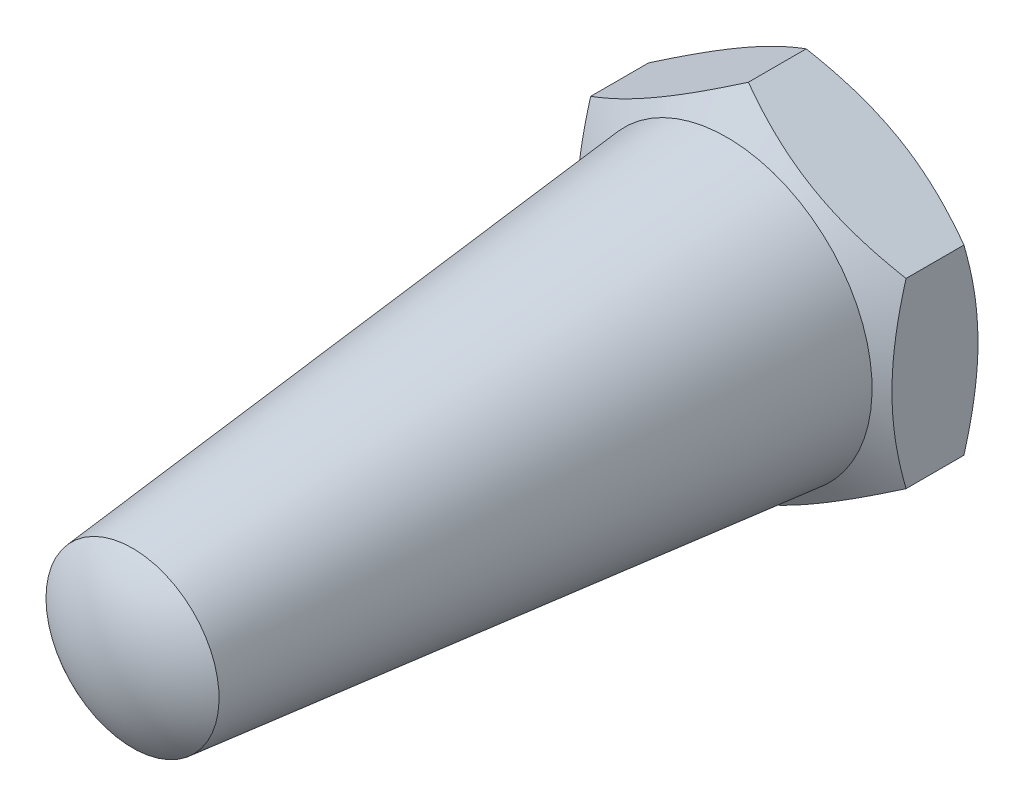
ISO-10303-21;
HEADER;
FILE_DESCRIPTION(('STEP AP214'),'2;1');
FILE_NAME('part.step','',(''),(''),'','','');
FILE_SCHEMA(('AUTOMOTIVE_DESIGN { 1 0 10303 214 1 1 1 1 }'));
ENDSEC;
DATA;
#1=APPLICATION_CONTEXT('core data for automotive mechanical design processes');
#2=APPLICATION_PROTOCOL_DEFINITION('international standard','automotive_design',2000,#1);
#3=PRODUCT_CONTEXT('',#1,'mechanical');
#4=PRODUCT('Part','Part','',(#3));
#5=PRODUCT_RELATED_PRODUCT_CATEGORY('part','',(#4));
#6=PRODUCT_DEFINITION_FORMATION('','',#4);
#7=PRODUCT_DEFINITION_CONTEXT('part definition',#1,'design');
#8=PRODUCT_DEFINITION('design','',#6,#7);
#9=PRODUCT_DEFINITION_SHAPE('','',#8);
#10=(LENGTH_UNIT() NAMED_UNIT(*) SI_UNIT(.MILLI.,.METRE.));
#11=(NAMED_UNIT(*) PLANE_ANGLE_UNIT() SI_UNIT($,.RADIAN.));
#12=(NAMED_UNIT(*) SI_UNIT($,.STERADIAN.) SOLID_ANGLE_UNIT());
#13=UNCERTAINTY_MEASURE_WITH_UNIT(LENGTH_MEASURE(1.E-05),#10,'distance_accuracy_value','');
#14=(GEOMETRIC_REPRESENTATION_CONTEXT(3) GLOBAL_UNCERTAINTY_ASSIGNED_CONTEXT((#13)) GLOBAL_UNIT_ASSIGNED_CONTEXT((#10,
#11,#12)) REPRESENTATION_CONTEXT('',''));
#15=CARTESIAN_POINT('',(0.,0.,0.));
#16=DIRECTION('',(0.,0.,1.));
#17=DIRECTION('',(1.,0.,0.));
#18=AXIS2_PLACEMENT_3D('',#15,#16,#17);
#19=CARTESIAN_POINT('',(0.,0.,0.));
#20=DIRECTION('',(0.,0.,1.));
#21=DIRECTION('',(-0.500000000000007,-0.866025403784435,0.));
#22=AXIS2_PLACEMENT_3D('',#19,#20,#21);
#23=CONICAL_SURFACE('',#22,5.5,1.0471975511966);
#24=CARTESIAN_POINT('',(-5.5,-3.1756574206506,0.491306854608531));
#25=CARTESIAN_POINT('',(-5.5,-3.03605808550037,0.451013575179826));
#26=CARTESIAN_POINT('',(-5.5,-2.89593825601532,0.412548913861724));
#27=CARTESIAN_POINT('',(-5.5,-2.61456066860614,0.339780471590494));
#28=CARTESIAN_POINT('',(-5.5,-2.47330244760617,0.30547848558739));
#29=CARTESIAN_POINT('',(-5.5,-2.0472660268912,0.20948981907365));
#30=CARTESIAN_POINT('',(-5.5,-1.76080610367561,0.154892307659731));
#31=CARTESIAN_POINT('',(-5.5,-1.33212403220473,0.0908698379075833));
#32=CARTESIAN_POINT('',(-5.5,-1.19118276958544,0.0726315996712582));
#33=CARTESIAN_POINT('',(-5.5,-0.908663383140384,0.0420485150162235));
#34=CARTESIAN_POINT('',(-5.5,-0.767085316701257,0.029703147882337));
#35=CARTESIAN_POINT('',(-5.5,-0.483683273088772,0.0112204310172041));
#36=CARTESIAN_POINT('',(-5.5,-0.341859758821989,0.00507603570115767));
#37=CARTESIAN_POINT('',(-5.5,-0.0580895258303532,-0.000879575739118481));
#38=CARTESIAN_POINT('',(-5.5,0.0838571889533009,-0.000690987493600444));
#39=CARTESIAN_POINT('',(-5.5,0.472750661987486,0.0085309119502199));
#40=CARTESIAN_POINT('',(-5.5,0.719570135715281,0.0240139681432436));
#41=CARTESIAN_POINT('',(-5.5,1.21156971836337,0.0731121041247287));
#42=CARTESIAN_POINT('',(-5.5,1.45674809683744,0.1067439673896));
#43=CARTESIAN_POINT('',(-5.5,1.94973792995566,0.190814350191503));
#44=CARTESIAN_POINT('',(-5.5,2.19748717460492,0.241609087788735));
#45=CARTESIAN_POINT('',(-5.5,2.68929089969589,0.356892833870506));
#46=CARTESIAN_POINT('',(-5.5,2.93335167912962,0.421354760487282));
#47=CARTESIAN_POINT('',(-5.5,3.17565742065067,0.491306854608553));
#48=B_SPLINE_CURVE_WITH_KNOTS('',3,(#24,#25,#26,#27,#28,#29,#30,#31,#32,#33,#34,#35,#36,#37,#38,
#39,#40,#41,#42,#43,#44,#45,#46,#47),.UNSPECIFIED.,.F.,.F.,(4,2,2,2,2,2,2,2,2,2,2,4),(0.,
0.435859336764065,0.871905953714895,1.74581116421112,2.17206086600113,2.59827289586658,
3.02400011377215,3.44971418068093,4.19085033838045,4.93267305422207,5.6909489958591,
6.44773620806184),.UNSPECIFIED.);
#49=CARTESIAN_POINT('',(-5.5,0.,0.));
#50=VERTEX_POINT('',#49);
#51=CARTESIAN_POINT('',(-5.5,3.175426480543,0.491240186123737));
#52=VERTEX_POINT('',#51);
#53=EDGE_CURVE('E144',#50,#52,#48,.T.);
#54=ORIENTED_EDGE('',*,*,#53,.T.);
#55=CARTESIAN_POINT('',(-5.5002,3.17531101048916,0.491306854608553));
#56=CARTESIAN_POINT('',(-5.37930342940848,3.24511067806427,0.451013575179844));
#57=CARTESIAN_POINT('',(-5.25795609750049,3.31517059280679,0.41254891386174));
#58=CARTESIAN_POINT('',(-5.01427595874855,3.45585938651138,0.339780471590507));
#59=CARTESIAN_POINT('',(-4.89194275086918,3.52648849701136,0.305478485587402));
#60=CARTESIAN_POINT('',(-4.52298438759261,3.73950670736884,0.20948981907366));
#61=CARTESIAN_POINT('',(-4.27490281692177,3.88273666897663,0.154892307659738));
#62=CARTESIAN_POINT('',(-3.90365325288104,4.09707770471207,0.0908698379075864));
#63=CARTESIAN_POINT('',(-3.78159453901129,4.16754833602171,0.0726315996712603));
#64=CARTESIAN_POINT('',(-3.53692557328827,4.30880802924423,0.0420485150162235));
#65=CARTESIAN_POINT('',(-3.4143153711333,4.3795970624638,0.0297031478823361));
#66=CARTESIAN_POINT('',(-3.16888200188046,4.52129808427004,0.0112204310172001));
#67=CARTESIAN_POINT('',(-3.04605923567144,4.59220984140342,0.00507603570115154));
#68=CARTESIAN_POINT('',(-2.80030700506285,4.73409495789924,-0.000879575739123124));
#69=CARTESIAN_POINT('',(-2.67737754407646,4.80506831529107,-0.000690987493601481));
#70=CARTESIAN_POINT('',(-2.34058591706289,4.99951505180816,0.00853091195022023));
#71=CARTESIAN_POINT('',(-2.12683398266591,5.12292478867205,0.0240139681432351));
#72=CARTESIAN_POINT('',(-1.70074984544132,5.36892457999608,0.0731121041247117));
#73=CARTESIAN_POINT('',(-1.48841914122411,5.49151376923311,0.106743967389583));
#74=CARTESIAN_POINT('',(-1.06147742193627,5.73800868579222,0.190814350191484));
#75=CARTESIAN_POINT('',(-0.846920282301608,5.86188330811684,0.241609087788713));
#76=CARTESIAN_POINT('',(-0.421005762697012,6.10778517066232,0.356892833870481));
#77=CARTESIAN_POINT('',(-0.209642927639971,6.22981556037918,0.421354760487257));
#78=CARTESIAN_POINT('',(0.000200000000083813,6.3509684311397,0.49130685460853));
#79=B_SPLINE_CURVE_WITH_KNOTS('',3,(#55,#56,#57,#58,#59,#60,#61,#62,#63,#64,#65,#66,#67,#68,#69,
#70,#71,#72,#73,#74,#75,#76,#77,#78),.UNSPECIFIED.,.F.,.F.,(4,2,2,2,2,2,2,2,2,2,2,4),(0.,
0.43585933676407,0.871905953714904,1.74581116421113,2.17206086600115,2.59827289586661,
3.02400011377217,3.44971418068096,4.19085033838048,4.93267305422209,5.69094899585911,
6.44773620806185),.UNSPECIFIED.);
#80=CARTESIAN_POINT('',(-2.74999999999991,4.76313972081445,0.));
#81=VERTEX_POINT('',#80);
#82=EDGE_CURVE('E96',#52,#81,#79,.T.);
#83=ORIENTED_EDGE('',*,*,#82,.T.);
#84=CARTESIAN_POINT('',(0.,0.,0.));
#85=DIRECTION('',(0.,0.,-1.));
#86=DIRECTION('',(0.500000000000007,0.866025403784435,0.));
#87=AXIS2_PLACEMENT_3D('',#84,#85,#86);
#88=CIRCLE('',#87,5.5);
#89=EDGE_CURVE('E107',#50,#81,#88,.T.);
#90=ORIENTED_EDGE('',*,*,#89,.F.);
#91=EDGE_LOOP('',(#54,#83,#90));
#92=FACE_BOUND('',#91,.T.);
#93=ADVANCED_FACE('F14',(#92),#23,.T.);
#94=CARTESIAN_POINT('',(2.75000000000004,4.76313972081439,0.));
#95=VERTEX_POINT('',#94);
#96=EDGE_CURVE('E104',#81,#95,#88,.T.);
#97=ORIENTED_EDGE('',*,*,#96,.F.);
#98=CARTESIAN_POINT('',(0.,6.35085296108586,0.491240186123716));
#99=VERTEX_POINT('',#98);
#100=EDGE_CURVE('E110',#81,#99,#79,.T.);
#101=ORIENTED_EDGE('',*,*,#100,.T.);
#102=CARTESIAN_POINT('',(-4.665275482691,9.04435101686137,2.70008996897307));
#103=CARTESIAN_POINT('',(-4.45700252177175,8.92410456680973,2.58329769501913));
#104=CARTESIAN_POINT('',(-4.24825451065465,8.80358384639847,2.46761578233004));
#105=CARTESIAN_POINT('',(-3.82955588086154,8.56184807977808,2.23909648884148));
#106=CARTESIAN_POINT('',(-3.61960508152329,8.44063292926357,2.12625954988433));
#107=CARTESIAN_POINT('',(-3.19718017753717,8.19674579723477,1.90349331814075));
#108=CARTESIAN_POINT('',(-2.98469857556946,8.07406948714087,1.79358291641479));
#109=CARTESIAN_POINT('',(-2.55805535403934,7.82774690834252,1.57821612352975));
#110=CARTESIAN_POINT('',(-2.34389381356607,7.70410068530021,1.47275952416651));
#111=CARTESIAN_POINT('',(-1.90651825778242,7.45158179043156,1.26412065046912));
#112=CARTESIAN_POINT('',(-1.68323704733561,7.3226703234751,1.16112517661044));
#113=CARTESIAN_POINT('',(-1.23407282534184,7.06334523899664,0.962850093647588));
#114=CARTESIAN_POINT('',(-1.00818952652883,6.93293145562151,0.867571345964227));
#115=CARTESIAN_POINT('',(-0.553875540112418,6.67063315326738,0.68720695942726));
#116=CARTESIAN_POINT('',(-0.325450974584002,6.53875216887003,0.60210096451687));
#117=CARTESIAN_POINT('',(0.134674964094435,6.27309833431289,0.444791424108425));
#118=CARTESIAN_POINT('',(0.36637528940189,6.1393260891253,0.372583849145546));
#119=CARTESIAN_POINT('',(0.831886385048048,5.87056313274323,0.24490271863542));
#120=CARTESIAN_POINT('',(1.06567780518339,5.73558359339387,0.18933682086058));
#121=CARTESIAN_POINT('',(1.53619803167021,5.46392861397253,0.0980537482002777));
#122=CARTESIAN_POINT('',(1.77292655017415,5.32725334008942,0.06233464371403));
#123=CARTESIAN_POINT('',(2.24503491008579,5.05468145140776,0.0140608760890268));
#124=CARTESIAN_POINT('',(2.48039113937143,4.91879846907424,0.00120590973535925));
#125=CARTESIAN_POINT('',(2.95120766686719,4.64697242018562,-0.00104219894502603));
#126=CARTESIAN_POINT('',(3.18666796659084,4.5110293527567,0.0095650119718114));
#127=CARTESIAN_POINT('',(3.58557345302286,4.28072116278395,0.0466564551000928));
#128=CARTESIAN_POINT('',(3.74944198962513,4.18611161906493,0.067426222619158));
#129=CARTESIAN_POINT('',(4.07599088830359,3.99757852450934,0.119054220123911));
#130=CARTESIAN_POINT('',(4.2386710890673,3.90365506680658,0.149913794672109));
#131=CARTESIAN_POINT('',(4.72470686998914,3.62304217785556,0.256006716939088));
#132=CARTESIAN_POINT('',(5.04587836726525,3.43761372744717,0.34473536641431));
#133=CARTESIAN_POINT('',(5.52614162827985,3.16033360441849,0.498757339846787));
#134=CARTESIAN_POINT('',(5.68771938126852,3.06704664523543,0.554305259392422));
#135=CARTESIAN_POINT('',(6.00930564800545,2.88137872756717,0.671212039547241));
#136=CARTESIAN_POINT('',(6.16931415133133,2.78899777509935,0.732570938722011));
#137=CARTESIAN_POINT('',(6.4878117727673,2.60511308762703,0.860111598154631));
#138=CARTESIAN_POINT('',(6.64630136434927,2.51360907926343,0.92629179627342));
#139=CARTESIAN_POINT('',(6.96196516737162,2.33136049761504,1.06269233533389));
#140=CARTESIAN_POINT('',(7.1191393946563,2.24061591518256,1.13291262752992));
#141=CARTESIAN_POINT('',(7.49164400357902,2.02555027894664,1.30396587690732));
#142=CARTESIAN_POINT('',(7.70645001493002,1.90153197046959,1.40631864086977));
#143=CARTESIAN_POINT('',(8.13421533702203,1.65456154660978,1.61606120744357));
#144=CARTESIAN_POINT('',(8.34717452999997,1.53160949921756,1.72345132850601));
#145=CARTESIAN_POINT('',(8.7715877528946,1.2865744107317,1.94225171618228));
#146=CARTESIAN_POINT('',(8.98304145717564,1.1644915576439,2.05366282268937));
#147=CARTESIAN_POINT('',(9.40466020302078,0.92106986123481,2.2796959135));
#148=CARTESIAN_POINT('',(9.61482521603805,0.799731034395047,2.39431796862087));
#149=CARTESIAN_POINT('',(10.0343046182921,0.557544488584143,2.62629189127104));
#150=CARTESIAN_POINT('',(10.2436178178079,0.436697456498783,2.74364662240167));
#151=CARTESIAN_POINT('',(10.6613340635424,0.195528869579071,2.98049832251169));
#152=CARTESIAN_POINT('',(10.8697371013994,0.075207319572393,3.09999531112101));
#153=CARTESIAN_POINT('',(11.4937420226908,-0.285062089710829,3.46109375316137));
#154=CARTESIAN_POINT('',(11.9081979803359,-0.524348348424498,3.70533517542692));
#155=CARTESIAN_POINT('',(12.6998512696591,-0.981409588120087,4.17784413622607));
#156=CARTESIAN_POINT('',(13.077228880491,-1.19928865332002,4.4057107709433));
#157=CARTESIAN_POINT('',(13.8305759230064,-1.63423377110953,4.86456308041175));
#158=CARTESIAN_POINT('',(14.2065453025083,-1.85129979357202,5.09554886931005));
#159=CARTESIAN_POINT('',(14.9564251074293,-2.28424310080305,5.55929876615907));
#160=CARTESIAN_POINT('',(15.3303383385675,-2.50012200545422,5.79205683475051));
#161=CARTESIAN_POINT('',(16.077265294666,-2.93136048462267,6.25943215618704));
#162=CARTESIAN_POINT('',(16.4502790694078,-3.14672008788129,6.49404930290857));
#163=CARTESIAN_POINT('',(16.8229623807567,-3.36188889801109,6.72935957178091));
#164=B_SPLINE_CURVE_WITH_KNOTS('',3,(#102,#103,#104,#105,#106,#107,#108,#109,#110,#111,#112,
#113,#114,#115,#116,#117,#118,#119,#120,#121,#122,#123,#124,#125,#126,#127,#128,#129,#130,#131,
#132,#133,#134,#135,#136,#137,#138,#139,#140,#141,#142,#143,#144,#145,#146,#147,#148,#149,#150,
#151,#152,#153,#154,#155,#156,#157,#158,#159,#160,#161,#162,#163),.UNSPECIFIED.,.F.,.F.,(4,2,2,
2,2,2,2,2,2,2,2,2,2,2,2,2,2,2,2,2,2,2,2,2,2,2,2,2,2,2,4),(0.,0.8020666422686,1.60425709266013,
2.41075980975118,3.21722478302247,4.05003181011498,4.88293167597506,5.71413594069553,
6.54508008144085,7.37132416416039,8.19748790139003,9.01271815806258,9.82796068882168,
10.3987510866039,10.9696175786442,12.1119712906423,12.6959233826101,13.2798793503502,
13.863646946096,14.4474074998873,15.2523068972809,16.0572572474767,16.8623767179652,
17.667513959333,18.4735366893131,19.2795668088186,20.8914029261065,22.3666098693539,
23.84187094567,25.3133687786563,26.7847832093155),.UNSPECIFIED.);
#165=EDGE_CURVE('E182',#99,#95,#164,.T.);
#166=ORIENTED_EDGE('',*,*,#165,.T.);
#167=EDGE_LOOP('',(#97,#101,#166));
#168=FACE_BOUND('',#167,.T.);
#169=ADVANCED_FACE('F139',(#168),#23,.T.);
#170=CARTESIAN_POINT('',(5.5,0.,0.));
#171=VERTEX_POINT('',#170);
#172=EDGE_CURVE('E109',#95,#171,#88,.T.);
#173=ORIENTED_EDGE('',*,*,#172,.F.);
#174=CARTESIAN_POINT('',(5.5,3.17542648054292,0.491240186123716));
#175=VERTEX_POINT('',#174);
#176=EDGE_CURVE('E175',#95,#175,#164,.T.);
#177=ORIENTED_EDGE('',*,*,#176,.T.);
#178=CARTESIAN_POINT('',(5.5,3.1756574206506,0.491306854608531));
#179=CARTESIAN_POINT('',(5.5,3.03605808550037,0.451013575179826));
#180=CARTESIAN_POINT('',(5.5,2.89593825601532,0.412548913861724));
#181=CARTESIAN_POINT('',(5.5,2.61456066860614,0.339780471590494));
#182=CARTESIAN_POINT('',(5.5,2.47330244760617,0.30547848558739));
#183=CARTESIAN_POINT('',(5.5,2.0472660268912,0.20948981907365));
#184=CARTESIAN_POINT('',(5.5,1.76080610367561,0.154892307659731));
#185=CARTESIAN_POINT('',(5.5,1.33212403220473,0.0908698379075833));
#186=CARTESIAN_POINT('',(5.5,1.19118276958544,0.0726315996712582));
#187=CARTESIAN_POINT('',(5.5,0.908663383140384,0.0420485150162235));
#188=CARTESIAN_POINT('',(5.5,0.767085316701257,0.029703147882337));
#189=CARTESIAN_POINT('',(5.5,0.483683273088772,0.0112204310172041));
#190=CARTESIAN_POINT('',(5.5,0.341859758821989,0.00507603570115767));
#191=CARTESIAN_POINT('',(5.5,0.0580895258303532,-0.000879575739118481));
#192=CARTESIAN_POINT('',(5.5,-0.0838571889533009,-0.000690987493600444));
#193=CARTESIAN_POINT('',(5.5,-0.472750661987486,0.0085309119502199));
#194=CARTESIAN_POINT('',(5.5,-0.719570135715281,0.0240139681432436));
#195=CARTESIAN_POINT('',(5.5,-1.21156971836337,0.0731121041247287));
#196=CARTESIAN_POINT('',(5.5,-1.45674809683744,0.1067439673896));
#197=CARTESIAN_POINT('',(5.5,-1.94973792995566,0.190814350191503));
#198=CARTESIAN_POINT('',(5.5,-2.19748717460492,0.241609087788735));
#199=CARTESIAN_POINT('',(5.5,-2.68929089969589,0.356892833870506));
#200=CARTESIAN_POINT('',(5.5,-2.93335167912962,0.421354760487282));
#201=CARTESIAN_POINT('',(5.5,-3.17565742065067,0.491306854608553));
#202=B_SPLINE_CURVE_WITH_KNOTS('',3,(#178,#179,#180,#181,#182,#183,#184,#185,#186,#187,#188,
#189,#190,#191,#192,#193,#194,#195,#196,#197,#198,#199,#200,#201),.UNSPECIFIED.,.F.,.F.,(4,2,2,
2,2,2,2,2,2,2,2,4),(0.,0.435859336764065,0.871905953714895,1.74581116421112,2.17206086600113,
2.59827289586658,3.02400011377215,3.44971418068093,4.19085033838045,4.93267305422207,
5.6909489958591,6.44773620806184),.UNSPECIFIED.);
#203=EDGE_CURVE('E219',#175,#171,#202,.T.);
#204=ORIENTED_EDGE('',*,*,#203,.T.);
#205=EDGE_LOOP('',(#173,#177,#204));
#206=FACE_BOUND('',#205,.T.);
#207=ADVANCED_FACE('F282',(#206),#23,.T.);
#208=CARTESIAN_POINT('',(2.74999999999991,-4.76313972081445,0.));
#209=VERTEX_POINT('',#208);
#210=EDGE_CURVE('E271',#171,#209,#88,.T.);
#211=ORIENTED_EDGE('',*,*,#210,.F.);
#212=CARTESIAN_POINT('',(5.5,-3.175426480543,0.491240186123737));
#213=VERTEX_POINT('',#212);
#214=EDGE_CURVE('E167',#171,#213,#202,.T.);
#215=ORIENTED_EDGE('',*,*,#214,.T.);
#216=CARTESIAN_POINT('',(5.5002,-3.17531101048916,0.491306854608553));
#217=CARTESIAN_POINT('',(5.37930342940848,-3.24511067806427,0.451013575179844));
#218=CARTESIAN_POINT('',(5.25795609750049,-3.31517059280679,0.41254891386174));
#219=CARTESIAN_POINT('',(5.01427595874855,-3.45585938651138,0.339780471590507));
#220=CARTESIAN_POINT('',(4.89194275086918,-3.52648849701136,0.305478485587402));
#221=CARTESIAN_POINT('',(4.52298438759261,-3.73950670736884,0.20948981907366));
#222=CARTESIAN_POINT('',(4.27490281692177,-3.88273666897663,0.154892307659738));
#223=CARTESIAN_POINT('',(3.90365325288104,-4.09707770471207,0.0908698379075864));
#224=CARTESIAN_POINT('',(3.78159453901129,-4.16754833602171,0.0726315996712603));
#225=CARTESIAN_POINT('',(3.53692557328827,-4.30880802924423,0.0420485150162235));
#226=CARTESIAN_POINT('',(3.4143153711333,-4.3795970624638,0.0297031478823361));
#227=CARTESIAN_POINT('',(3.16888200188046,-4.52129808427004,0.0112204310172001));
#228=CARTESIAN_POINT('',(3.04605923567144,-4.59220984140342,0.00507603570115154));
#229=CARTESIAN_POINT('',(2.80030700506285,-4.73409495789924,-0.000879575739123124));
#230=CARTESIAN_POINT('',(2.67737754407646,-4.80506831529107,-0.000690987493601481));
#231=CARTESIAN_POINT('',(2.34058591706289,-4.99951505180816,0.00853091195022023));
#232=CARTESIAN_POINT('',(2.12683398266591,-5.12292478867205,0.0240139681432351));
#233=CARTESIAN_POINT('',(1.70074984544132,-5.36892457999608,0.0731121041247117));
#234=CARTESIAN_POINT('',(1.48841914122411,-5.49151376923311,0.106743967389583));
#235=CARTESIAN_POINT('',(1.06147742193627,-5.73800868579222,0.190814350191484));
#236=CARTESIAN_POINT('',(0.846920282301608,-5.86188330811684,0.241609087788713));
#237=CARTESIAN_POINT('',(0.421005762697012,-6.10778517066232,0.356892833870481));
#238=CARTESIAN_POINT('',(0.209642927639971,-6.22981556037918,0.421354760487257));
#239=CARTESIAN_POINT('',(-0.000200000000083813,-6.3509684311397,0.49130685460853));
#240=B_SPLINE_CURVE_WITH_KNOTS('',3,(#216,#217,#218,#219,#220,#221,#222,#223,#224,#225,#226,
#227,#228,#229,#230,#231,#232,#233,#234,#235,#236,#237,#238,#239),.UNSPECIFIED.,.F.,.F.,(4,2,2,
2,2,2,2,2,2,2,2,4),(0.,0.43585933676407,0.871905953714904,1.74581116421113,2.17206086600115,
2.59827289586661,3.02400011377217,3.44971418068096,4.19085033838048,4.93267305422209,
5.69094899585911,6.44773620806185),.UNSPECIFIED.);
#241=EDGE_CURVE('E217',#213,#209,#240,.T.);
#242=ORIENTED_EDGE('',*,*,#241,.T.);
#243=EDGE_LOOP('',(#211,#215,#242));
#244=FACE_BOUND('',#243,.T.);
#245=ADVANCED_FACE('F283',(#244),#23,.T.);
#246=CARTESIAN_POINT('',(-2.75000000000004,-4.76313972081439,0.));
#247=VERTEX_POINT('',#246);
#248=EDGE_CURVE('E277',#209,#247,#88,.T.);
#249=ORIENTED_EDGE('',*,*,#248,.F.);
#250=CARTESIAN_POINT('',(0.,-6.35085296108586,0.491240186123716));
#251=VERTEX_POINT('',#250);
#252=EDGE_CURVE('E159',#209,#251,#240,.T.);
#253=ORIENTED_EDGE('',*,*,#252,.T.);
#254=CARTESIAN_POINT('',(-10.1652754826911,-0.481928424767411,2.70008996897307));
#255=CARTESIAN_POINT('',(-9.95700252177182,-0.602174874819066,2.58329769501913));
#256=CARTESIAN_POINT('',(-9.74825451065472,-0.722695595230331,2.46761578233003));
#257=CARTESIAN_POINT('',(-9.32955588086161,-0.964431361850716,2.23909648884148));
#258=CARTESIAN_POINT('',(-9.11960508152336,-1.08564651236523,2.12625954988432));
#259=CARTESIAN_POINT('',(-8.69718017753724,-1.32953364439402,1.90349331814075));
#260=CARTESIAN_POINT('',(-8.48469857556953,-1.45220995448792,1.79358291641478));
#261=CARTESIAN_POINT('',(-8.05805535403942,-1.69853253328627,1.57821612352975));
#262=CARTESIAN_POINT('',(-7.84389381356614,-1.82217875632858,1.47275952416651));
#263=CARTESIAN_POINT('',(-7.4065182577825,-2.07469765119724,1.26412065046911));
#264=CARTESIAN_POINT('',(-7.18323704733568,-2.20360911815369,1.16112517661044));
#265=CARTESIAN_POINT('',(-6.73407282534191,-2.46293420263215,0.962850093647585));
#266=CARTESIAN_POINT('',(-6.5081895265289,-2.59334798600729,0.867571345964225));
#267=CARTESIAN_POINT('',(-6.0538755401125,-2.85564628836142,0.687206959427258));
#268=CARTESIAN_POINT('',(-5.82545097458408,-2.98752727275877,0.602100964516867));
#269=CARTESIAN_POINT('',(-5.36532503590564,-3.2531811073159,0.444791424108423));
#270=CARTESIAN_POINT('',(-5.13362471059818,-3.38695335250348,0.372583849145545));
#271=CARTESIAN_POINT('',(-4.66811361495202,-3.65571630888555,0.24490271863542));
#272=CARTESIAN_POINT('',(-4.43432219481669,-3.79069584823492,0.18933682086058));
#273=CARTESIAN_POINT('',(-3.96380196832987,-4.06235082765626,0.0980537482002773));
#274=CARTESIAN_POINT('',(-3.72707344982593,-4.19902610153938,0.0623346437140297));
#275=CARTESIAN_POINT('',(-3.25496508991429,-4.47159799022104,0.0140608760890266));
#276=CARTESIAN_POINT('',(-3.01960886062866,-4.60748097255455,0.00120590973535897));
#277=CARTESIAN_POINT('',(-2.54879233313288,-4.87930702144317,-0.00104219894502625));
#278=CARTESIAN_POINT('',(-2.31333203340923,-5.01525008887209,0.00956501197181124));
#279=CARTESIAN_POINT('',(-1.91442654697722,-5.24555827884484,0.046656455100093));
#280=CARTESIAN_POINT('',(-1.75055801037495,-5.34016782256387,0.0674262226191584));
#281=CARTESIAN_POINT('',(-1.42400911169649,-5.52870091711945,0.119054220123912));
#282=CARTESIAN_POINT('',(-1.26132891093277,-5.62262437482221,0.14991379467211));
#283=CARTESIAN_POINT('',(-0.775293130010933,-5.90323726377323,0.256006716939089));
#284=CARTESIAN_POINT('',(-0.454121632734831,-6.08866571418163,0.344735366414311));
#285=CARTESIAN_POINT('',(0.0261416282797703,-6.3659458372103,0.498757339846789));
#286=CARTESIAN_POINT('',(0.187719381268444,-6.45923279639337,0.554305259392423));
#287=CARTESIAN_POINT('',(0.509305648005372,-6.64490071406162,0.671212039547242));
#288=CARTESIAN_POINT('',(0.669314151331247,-6.73728166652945,0.732570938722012));
#289=CARTESIAN_POINT('',(0.987811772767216,-6.92116635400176,0.860111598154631));
#290=CARTESIAN_POINT('',(1.14630136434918,-7.01267036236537,0.926291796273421));
#291=CARTESIAN_POINT('',(1.46196516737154,-7.19491894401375,1.06269233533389));
#292=CARTESIAN_POINT('',(1.61913939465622,-7.28566352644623,1.13291262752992));
#293=CARTESIAN_POINT('',(1.99164400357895,-7.50072916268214,1.30396587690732));
#294=CARTESIAN_POINT('',(2.20645001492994,-7.6247474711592,1.40631864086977));
#295=CARTESIAN_POINT('',(2.63421533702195,-7.87171789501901,1.61606120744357));
#296=CARTESIAN_POINT('',(2.84717452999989,-7.99466994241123,1.72345132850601));
#297=CARTESIAN_POINT('',(3.27158775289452,-8.23970503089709,1.94225171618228));
#298=CARTESIAN_POINT('',(3.48304145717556,-8.36178788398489,2.05366282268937));
#299=CARTESIAN_POINT('',(3.9046602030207,-8.60520958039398,2.27969591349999));
#300=CARTESIAN_POINT('',(4.11482521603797,-8.72654840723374,2.39431796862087));
#301=CARTESIAN_POINT('',(4.53430461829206,-8.96873495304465,2.62629189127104));
#302=CARTESIAN_POINT('',(4.7436178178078,-9.08958198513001,2.74364662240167));
#303=CARTESIAN_POINT('',(5.16133406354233,-9.33075057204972,2.98049832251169));
#304=CARTESIAN_POINT('',(5.36973710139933,-9.4510721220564,3.09999531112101));
#305=CARTESIAN_POINT('',(5.99374202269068,-9.81134153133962,3.46109375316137));
#306=CARTESIAN_POINT('',(6.40819798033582,-10.0506277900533,3.70533517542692));
#307=CARTESIAN_POINT('',(7.19985126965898,-10.5076890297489,4.17784413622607));
#308=CARTESIAN_POINT('',(7.57722888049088,-10.7255680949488,4.4057107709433));
#309=CARTESIAN_POINT('',(8.33057592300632,-11.1605132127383,4.86456308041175));
#310=CARTESIAN_POINT('',(8.70654530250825,-11.3775792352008,5.09554886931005));
#311=CARTESIAN_POINT('',(9.45642510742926,-11.8105225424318,5.55929876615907));
#312=CARTESIAN_POINT('',(9.83033833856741,-12.026401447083,5.79205683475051));
#313=CARTESIAN_POINT('',(10.5772652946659,-12.4576399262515,6.25943215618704));
#314=CARTESIAN_POINT('',(10.9502790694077,-12.6729995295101,6.49404930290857));
#315=CARTESIAN_POINT('',(11.3229623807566,-12.8881683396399,6.72935957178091));
#316=B_SPLINE_CURVE_WITH_KNOTS('',3,(#254,#255,#256,#257,#258,#259,#260,#261,#262,#263,#264,
#265,#266,#267,#268,#269,#270,#271,#272,#273,#274,#275,#276,#277,#278,#279,#280,#281,#282,#283,
#284,#285,#286,#287,#288,#289,#290,#291,#292,#293,#294,#295,#296,#297,#298,#299,#300,#301,#302,
#303,#304,#305,#306,#307,#308,#309,#310,#311,#312,#313,#314,#315),.UNSPECIFIED.,.F.,.F.,(4,2,2,
2,2,2,2,2,2,2,2,2,2,2,2,2,2,2,2,2,2,2,2,2,2,2,2,2,2,2,4),(0.,0.8020666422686,1.60425709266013,
2.41075980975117,3.21722478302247,4.05003181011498,4.88293167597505,5.71413594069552,
6.54508008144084,7.37132416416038,8.19748790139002,9.01271815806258,9.82796068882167,
10.3987510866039,10.9696175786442,12.1119712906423,12.6959233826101,13.2798793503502,
13.863646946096,14.4474074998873,15.2523068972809,16.0572572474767,16.8623767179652,
17.667513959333,18.4735366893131,19.2795668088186,20.8914029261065,22.3666098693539,
23.84187094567,25.3133687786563,26.7847832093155),.UNSPECIFIED.);
#317=EDGE_CURVE('E228',#251,#247,#316,.F.);
#318=ORIENTED_EDGE('',*,*,#317,.T.);
#319=EDGE_LOOP('',(#249,#253,#318));
#320=FACE_BOUND('',#319,.T.);
#321=ADVANCED_FACE('F286',(#320),#23,.T.);
#322=EDGE_CURVE('E239',#247,#50,#88,.T.);
#323=ORIENTED_EDGE('',*,*,#322,.F.);
#324=CARTESIAN_POINT('',(-5.5,-3.17542648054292,0.491240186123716));
#325=VERTEX_POINT('',#324);
#326=EDGE_CURVE('E87',#247,#325,#316,.F.);
#327=ORIENTED_EDGE('',*,*,#326,.T.);
#328=EDGE_CURVE('E88',#325,#50,#48,.T.);
#329=ORIENTED_EDGE('',*,*,#328,.T.);
#330=EDGE_LOOP('',(#323,#327,#329));
#331=FACE_BOUND('',#330,.T.);
#332=ADVANCED_FACE('F135',(#331),#23,.T.);
#333=CARTESIAN_POINT('',(4.76313972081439,-2.75000000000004,0.));
#334=DIRECTION('',(0.,0.,-1.));
#335=DIRECTION('',(0.500000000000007,0.866025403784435,0.));
#336=AXIS2_PLACEMENT_3D('',#333,#334,#335);
#337=PLANE('',#336);
#338=CARTESIAN_POINT('',(0.,0.,0.));
#339=DIRECTION('',(0.,0.,-1.));
#340=DIRECTION('',(-0.866025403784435,0.500000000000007,0.));
#341=AXIS2_PLACEMENT_3D('',#338,#339,#340);
#342=CIRCLE('',#341,3.);
#343=CARTESIAN_POINT('',(-2.5980762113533,1.50000000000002,0.));
#344=VERTEX_POINT('',#343);
#345=EDGE_CURVE('E256',#344,#344,#342,.T.);
#346=ORIENTED_EDGE('',*,*,#345,.F.);
#347=EDGE_LOOP('',(#346));
#348=FACE_BOUND('',#347,.T.);
#349=ORIENTED_EDGE('',*,*,#172,.T.);
#350=ORIENTED_EDGE('',*,*,#210,.T.);
#351=ORIENTED_EDGE('',*,*,#248,.T.);
#352=ORIENTED_EDGE('',*,*,#322,.T.);
#353=ORIENTED_EDGE('',*,*,#89,.T.);
#354=ORIENTED_EDGE('',*,*,#96,.T.);
#355=EDGE_LOOP('',(#349,#350,#351,#352,#353,#354));
#356=FACE_BOUND('',#355,.T.);
#357=ADVANCED_FACE('F130',(#348,#356),#337,.T.);
#358=CARTESIAN_POINT('',(0.,6.35085296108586,-25.));
#359=DIRECTION('',(-0.499999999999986,0.866025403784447,0.));
#360=DIRECTION('',(-0.866025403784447,-0.499999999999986,0.));
#361=AXIS2_PLACEMENT_3D('',#358,#359,#360);
#362=PLANE('',#361);
#363=DIRECTION('',(0.,0.,1.));
#364=VECTOR('',#363,1.);
#365=CARTESIAN_POINT('',(0.,6.35085296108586,-25.));
#366=LINE('',#365,#364);
#367=CARTESIAN_POINT('',(0.,6.35085296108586,2.50875981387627));
#368=VERTEX_POINT('',#367);
#369=EDGE_CURVE('E254',#99,#368,#366,.T.);
#370=ORIENTED_EDGE('',*,*,#369,.F.);
#371=ORIENTED_EDGE('',*,*,#100,.F.);
#372=ORIENTED_EDGE('',*,*,#82,.F.);
#373=DIRECTION('',(0.,0.,1.));
#374=VECTOR('',#373,1.);
#375=CARTESIAN_POINT('',(-5.5,3.175426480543,-25.));
#376=LINE('',#375,#374);
#377=CARTESIAN_POINT('',(-5.5,3.175426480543,2.50875981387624));
#378=VERTEX_POINT('',#377);
#379=EDGE_CURVE('E35',#52,#378,#376,.T.);
#380=ORIENTED_EDGE('',*,*,#379,.T.);
#381=CARTESIAN_POINT('',(0.000200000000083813,6.3509684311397,2.50869314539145));
#382=CARTESIAN_POINT('',(-0.12069657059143,6.28116876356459,2.54898642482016));
#383=CARTESIAN_POINT('',(-0.242043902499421,6.21110884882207,2.58745108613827));
#384=CARTESIAN_POINT('',(-0.485724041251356,6.07042005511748,2.6602195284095));
#385=CARTESIAN_POINT('',(-0.608057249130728,5.99979094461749,2.6945215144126));
#386=CARTESIAN_POINT('',(-0.977015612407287,5.78677273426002,2.79051018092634));
#387=CARTESIAN_POINT('',(-1.22509718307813,5.64354277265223,2.84510769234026));
#388=CARTESIAN_POINT('',(-1.59634674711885,5.42920173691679,2.90913016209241));
#389=CARTESIAN_POINT('',(-1.71840546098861,5.35873110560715,2.92736840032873));
#390=CARTESIAN_POINT('',(-1.96307442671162,5.21747141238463,2.95795148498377));
#391=CARTESIAN_POINT('',(-2.08568462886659,5.14668237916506,2.97029685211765));
#392=CARTESIAN_POINT('',(-2.33111799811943,5.00498135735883,2.98877956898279));
#393=CARTESIAN_POINT('',(-2.45394076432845,4.93406960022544,2.99492396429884));
#394=CARTESIAN_POINT('',(-2.69969299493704,4.79218448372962,3.00087957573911));
#395=CARTESIAN_POINT('',(-2.82262245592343,4.7212111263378,3.00069098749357));
#396=CARTESIAN_POINT('',(-3.159414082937,4.52676438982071,2.99146908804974));
#397=CARTESIAN_POINT('',(-3.37316601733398,4.40335465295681,2.97598603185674));
#398=CARTESIAN_POINT('',(-3.79925015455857,4.15735486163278,2.92688789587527));
#399=CARTESIAN_POINT('',(-4.01158085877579,4.03476567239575,2.89325603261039));
#400=CARTESIAN_POINT('',(-4.43852257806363,3.78827075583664,2.80918564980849));
#401=CARTESIAN_POINT('',(-4.65307971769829,3.66439613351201,2.75839091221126));
#402=CARTESIAN_POINT('',(-5.0789942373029,3.41849427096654,2.64310716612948));
#403=CARTESIAN_POINT('',(-5.29035707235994,3.29646388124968,2.57864523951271));
#404=CARTESIAN_POINT('',(-5.5002,3.17531101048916,2.50869314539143));
#405=B_SPLINE_CURVE_WITH_KNOTS('',3,(#381,#382,#383,#384,#385,#386,#387,#388,#389,#390,#391,
#392,#393,#394,#395,#396,#397,#398,#399,#400,#401,#402,#403,#404),.UNSPECIFIED.,.F.,.F.,(4,2,2,
2,2,2,2,2,2,2,2,4),(0.,0.435859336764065,0.871905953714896,1.74581116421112,2.17206086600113,
2.59827289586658,3.02400011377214,3.44971418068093,4.19085033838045,4.93267305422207,
5.6909489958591,6.44773620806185),.UNSPECIFIED.);
#406=EDGE_CURVE('E93',#368,#378,#405,.T.);
#407=ORIENTED_EDGE('',*,*,#406,.F.);
#408=EDGE_LOOP('',(#370,#371,#372,#380,#407));
#409=FACE_BOUND('',#408,.T.);
#410=ADVANCED_FACE('F92',(#409),#362,.T.);
#411=CARTESIAN_POINT('',(5.5,3.17542648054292,-25.));
#412=DIRECTION('',(0.500000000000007,0.866025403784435,0.));
#413=DIRECTION('',(-0.866025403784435,0.500000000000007,0.));
#414=AXIS2_PLACEMENT_3D('',#411,#412,#413);
#415=PLANE('',#414);
#416=DIRECTION('',(0.,0.,1.));
#417=VECTOR('',#416,1.);
#418=CARTESIAN_POINT('',(5.5,3.17542648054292,-25.));
#419=LINE('',#418,#417);
#420=CARTESIAN_POINT('',(5.5,3.17542648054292,2.50875981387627));
#421=VERTEX_POINT('',#420);
#422=EDGE_CURVE('E251',#175,#421,#419,.T.);
#423=ORIENTED_EDGE('',*,*,#422,.F.);
#424=ORIENTED_EDGE('',*,*,#176,.F.);
#425=ORIENTED_EDGE('',*,*,#165,.F.);
#426=ORIENTED_EDGE('',*,*,#369,.T.);
#427=CARTESIAN_POINT('',(-4.63445341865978,9.02655588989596,0.317188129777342));
#428=CARTESIAN_POINT('',(-4.42642850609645,8.90645265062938,0.433698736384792));
#429=CARTESIAN_POINT('',(-4.21792578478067,8.78607354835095,0.549091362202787));
#430=CARTESIAN_POINT('',(-3.79971060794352,8.54461690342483,0.777011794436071));
#431=CARTESIAN_POINT('',(-3.58999796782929,8.42353925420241,0.889539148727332));
#432=CARTESIAN_POINT('',(-3.16802728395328,8.17991436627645,1.11166683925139));
#433=CARTESIAN_POINT('',(-2.95576159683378,8.05736271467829,1.22124788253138));
#434=CARTESIAN_POINT('',(-2.52954101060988,7.81128414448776,1.43592160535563));
#435=CARTESIAN_POINT('',(-2.31558619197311,7.6877572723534,1.54101449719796));
#436=CARTESIAN_POINT('',(-1.87876523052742,7.43555857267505,1.74880037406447));
#437=CARTESIAN_POINT('',(-1.6558329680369,7.3068485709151,1.85130903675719));
#438=CARTESIAN_POINT('',(-1.20735940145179,7.04792223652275,2.04856142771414));
#439=CARTESIAN_POINT('',(-0.981817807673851,6.9177057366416,2.14330428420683));
#440=CARTESIAN_POINT('',(-0.528189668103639,6.65580340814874,2.32253603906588));
#441=CARTESIAN_POINT('',(-0.300109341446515,6.52412117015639,2.40704571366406));
#442=CARTESIAN_POINT('',(0.159322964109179,6.25886780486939,2.56309752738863));
#443=CARTESIAN_POINT('',(0.390673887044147,6.12529728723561,2.63464375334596));
#444=CARTESIAN_POINT('',(0.855502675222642,5.85692826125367,2.76095502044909));
#445=CARTESIAN_POINT('',(1.08896178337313,5.72214058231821,2.81581040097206));
#446=CARTESIAN_POINT('',(1.55878077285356,5.45089046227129,2.90563425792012));
#447=CARTESIAN_POINT('',(1.79514037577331,5.31442818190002,2.94060462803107));
#448=CARTESIAN_POINT('',(2.26649270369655,5.04229278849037,2.98741101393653));
#449=CARTESIAN_POINT('',(2.50146273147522,4.90663277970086,2.99954428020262));
#450=CARTESIAN_POINT('',(2.97145539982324,4.63528238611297,3.00043005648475));
#451=CARTESIAN_POINT('',(3.20647804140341,4.49959200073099,2.9891820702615));
#452=CARTESIAN_POINT('',(3.60553078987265,4.26919878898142,2.95102792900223));
#453=CARTESIAN_POINT('',(3.76998818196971,4.17424926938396,2.92974037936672));
#454=CARTESIAN_POINT('',(4.09769047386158,3.98505026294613,2.87704309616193));
#455=CARTESIAN_POINT('',(4.26093520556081,3.89080087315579,2.84563198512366));
#456=CARTESIAN_POINT('',(4.74863690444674,3.60922616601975,2.73786529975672));
#457=CARTESIAN_POINT('',(5.07087880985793,3.42317971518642,2.64799613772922));
#458=CARTESIAN_POINT('',(5.55274402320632,3.1449747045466,2.49227965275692));
#459=CARTESIAN_POINT('',(5.71486728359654,3.05137279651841,2.43616090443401));
#460=CARTESIAN_POINT('',(6.03753849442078,2.86507848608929,2.31812622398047));
#461=CARTESIAN_POINT('',(6.19808643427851,2.77238608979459,2.25621025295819));
#462=CARTESIAN_POINT('',(6.51765874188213,2.58788093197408,2.12757219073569));
#463=CARTESIAN_POINT('',(6.67668359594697,2.49606788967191,2.06085169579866));
#464=CARTESIAN_POINT('',(6.99341719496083,2.31320166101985,1.92338647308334));
#465=CARTESIAN_POINT('',(7.15112595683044,2.22214846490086,1.85264179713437));
#466=CARTESIAN_POINT('',(7.52950150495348,2.00369324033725,1.67824012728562));
#467=CARTESIAN_POINT('',(7.74959700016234,1.87662104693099,1.57293336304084));
#468=CARTESIAN_POINT('',(8.18787356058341,1.62358195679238,1.35712011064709));
#469=CARTESIAN_POINT('',(8.40605449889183,1.49761513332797,1.24661328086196));
#470=CARTESIAN_POINT('',(8.84086446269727,1.24657748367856,1.02146878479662));
#471=CARTESIAN_POINT('',(9.05749314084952,1.12150685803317,0.906830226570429));
#472=CARTESIAN_POINT('',(9.48942656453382,0.87212997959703,0.674268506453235));
#473=CARTESIAN_POINT('',(9.70473128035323,0.747823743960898,0.556345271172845));
#474=CARTESIAN_POINT('',(10.1344754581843,0.499710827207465,0.317712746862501));
#475=CARTESIAN_POINT('',(10.3489136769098,0.375904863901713,0.197000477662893));
#476=CARTESIAN_POINT('',(10.7768618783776,0.128828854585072,-0.0466003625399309));
#477=CARTESIAN_POINT('',(10.9903718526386,0.00555881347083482,-0.169488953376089));
#478=CARTESIAN_POINT('',(11.6296754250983,-0.363543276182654,-0.540793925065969));
#479=CARTESIAN_POINT('',(12.0543041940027,-0.608702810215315,-0.791883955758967));
#480=CARTESIAN_POINT('',(12.8646905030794,-1.07657956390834,-1.27711141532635));
#481=CARTESIAN_POINT('',(13.250633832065,-1.29940404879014,-1.51083699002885));
#482=CARTESIAN_POINT('',(14.0211073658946,-1.74423715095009,-1.98141180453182));
#483=CARTESIAN_POINT('',(14.4056375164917,-1.96624573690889,-2.21826116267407));
#484=CARTESIAN_POINT('',(15.1726058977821,-2.40905513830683,-2.69371435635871));
#485=CARTESIAN_POINT('',(15.5550469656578,-2.62985759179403,-2.93231209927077));
#486=CARTESIAN_POINT('',(16.3190296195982,-3.07094318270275,-3.41136076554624));
#487=CARTESIAN_POINT('',(16.7005712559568,-3.29122634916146,-3.65181158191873));
#488=CARTESIAN_POINT('',(17.0817838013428,-3.51131951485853,-3.89295145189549));
#489=B_SPLINE_CURVE_WITH_KNOTS('',3,(#427,#428,#429,#430,#431,#432,#433,#434,#435,#436,#437,
#438,#439,#440,#441,#442,#443,#444,#445,#446,#447,#448,#449,#450,#451,#452,#453,#454,#455,#456,
#457,#458,#459,#460,#461,#462,#463,#464,#465,#466,#467,#468,#469,#470,#471,#472,#473,#474,#475,
#476,#477,#478,#479,#480,#481,#482,#483,#484,#485,#486,#487,#488),.UNSPECIFIED.,.F.,.F.,(4,2,2,
2,2,2,2,2,2,2,2,2,2,2,2,2,2,2,2,2,2,2,2,2,2,2,2,2,2,2,4),(0.,0.800924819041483,1.60197524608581,
2.40739108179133,3.21276877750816,4.04391063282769,4.87514566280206,5.70466370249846,
6.53391977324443,7.35860419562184,8.18321006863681,8.99700649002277,9.81082018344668,
10.3838076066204,10.9568730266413,12.1036361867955,12.6898898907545,13.2761475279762,
13.8622112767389,14.4482674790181,15.2734821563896,16.0987511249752,16.924199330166,
17.7496659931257,18.5760597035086,19.4024609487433,21.0550266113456,22.5646743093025,
24.0743793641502,25.5801946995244,27.0859237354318),.UNSPECIFIED.);
#490=EDGE_CURVE('E103',#421,#368,#489,.F.);
#491=ORIENTED_EDGE('',*,*,#490,.F.);
#492=EDGE_LOOP('',(#423,#424,#425,#426,#491));
#493=FACE_BOUND('',#492,.T.);
#494=ADVANCED_FACE('F129',(#493),#415,.T.);
#495=CARTESIAN_POINT('',(5.5,-3.175426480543,-25.));
#496=DIRECTION('',(1.,0.,0.));
#497=DIRECTION('',(0.,1.,0.));
#498=AXIS2_PLACEMENT_3D('',#495,#496,#497);
#499=PLANE('',#498);
#500=DIRECTION('',(0.,0.,1.));
#501=VECTOR('',#500,1.);
#502=CARTESIAN_POINT('',(5.5,-3.175426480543,-25.));
#503=LINE('',#502,#501);
#504=CARTESIAN_POINT('',(5.5,-3.175426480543,2.50875981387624));
#505=VERTEX_POINT('',#504);
#506=EDGE_CURVE('E246',#213,#505,#503,.T.);
#507=ORIENTED_EDGE('',*,*,#506,.F.);
#508=ORIENTED_EDGE('',*,*,#214,.F.);
#509=ORIENTED_EDGE('',*,*,#203,.F.);
#510=ORIENTED_EDGE('',*,*,#422,.T.);
#511=CARTESIAN_POINT('',(5.5,-3.17565742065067,2.50869314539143));
#512=CARTESIAN_POINT('',(5.5,-3.03605808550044,2.54898642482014));
#513=CARTESIAN_POINT('',(5.5,-2.8959382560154,2.58745108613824));
#514=CARTESIAN_POINT('',(5.5,-2.61456066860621,2.66021952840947));
#515=CARTESIAN_POINT('',(5.5,-2.47330244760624,2.69452151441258));
#516=CARTESIAN_POINT('',(5.5,-2.04726602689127,2.79051018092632));
#517=CARTESIAN_POINT('',(5.5,-1.76080610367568,2.84510769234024));
#518=CARTESIAN_POINT('',(5.5,-1.3321240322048,2.90913016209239));
#519=CARTESIAN_POINT('',(5.5,-1.19118276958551,2.92736840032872));
#520=CARTESIAN_POINT('',(5.5,-0.908663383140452,2.95795148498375));
#521=CARTESIAN_POINT('',(5.5,-0.767085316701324,2.97029685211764));
#522=CARTESIAN_POINT('',(5.5,-0.483683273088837,2.98877956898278));
#523=CARTESIAN_POINT('',(5.5,-0.341859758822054,2.99492396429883));
#524=CARTESIAN_POINT('',(5.5,-0.0580895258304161,3.0008795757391));
#525=CARTESIAN_POINT('',(5.5,0.083857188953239,3.00069098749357));
#526=CARTESIAN_POINT('',(5.5,0.472750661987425,2.99146908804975));
#527=CARTESIAN_POINT('',(5.5,0.719570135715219,2.97598603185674));
#528=CARTESIAN_POINT('',(5.5,1.21156971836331,2.92688789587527));
#529=CARTESIAN_POINT('',(5.5,1.45674809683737,2.8932560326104));
#530=CARTESIAN_POINT('',(5.5,1.9497379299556,2.80918564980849));
#531=CARTESIAN_POINT('',(5.5,2.19748717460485,2.75839091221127));
#532=CARTESIAN_POINT('',(5.5,2.68929089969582,2.6431071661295));
#533=CARTESIAN_POINT('',(5.5,2.93335167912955,2.57864523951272));
#534=CARTESIAN_POINT('',(5.5,3.1756574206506,2.50869314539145));
#535=B_SPLINE_CURVE_WITH_KNOTS('',3,(#511,#512,#513,#514,#515,#516,#517,#518,#519,#520,#521,
#522,#523,#524,#525,#526,#527,#528,#529,#530,#531,#532,#533,#534),.UNSPECIFIED.,.F.,.F.,(4,2,2,
2,2,2,2,2,2,2,2,4),(0.,0.435859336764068,0.871905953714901,1.74581116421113,2.17206086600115,
2.5982728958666,3.02400011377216,3.44971418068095,4.19085033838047,4.93267305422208,
5.69094899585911,6.44773620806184),.UNSPECIFIED.);
#536=EDGE_CURVE('E183',#505,#421,#535,.T.);
#537=ORIENTED_EDGE('',*,*,#536,.F.);
#538=EDGE_LOOP('',(#507,#508,#509,#510,#537));
#539=FACE_BOUND('',#538,.T.);
#540=ADVANCED_FACE('F195',(#539),#499,.T.);
#541=CARTESIAN_POINT('',(0.,-6.35085296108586,-25.));
#542=DIRECTION('',(0.499999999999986,-0.866025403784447,0.));
#543=DIRECTION('',(0.866025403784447,0.499999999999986,0.));
#544=AXIS2_PLACEMENT_3D('',#541,#542,#543);
#545=PLANE('',#544);
#546=DIRECTION('',(0.,0.,1.));
#547=VECTOR('',#546,1.);
#548=CARTESIAN_POINT('',(0.,-6.35085296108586,-25.));
#549=LINE('',#548,#547);
#550=CARTESIAN_POINT('',(0.,-6.35085296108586,2.50875981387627));
#551=VERTEX_POINT('',#550);
#552=EDGE_CURVE('E244',#251,#551,#549,.T.);
#553=ORIENTED_EDGE('',*,*,#552,.F.);
#554=ORIENTED_EDGE('',*,*,#252,.F.);
#555=ORIENTED_EDGE('',*,*,#241,.F.);
#556=ORIENTED_EDGE('',*,*,#506,.T.);
#557=CARTESIAN_POINT('',(-0.000200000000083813,-6.3509684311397,2.50869314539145));
#558=CARTESIAN_POINT('',(0.12069657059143,-6.28116876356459,2.54898642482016));
#559=CARTESIAN_POINT('',(0.242043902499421,-6.21110884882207,2.58745108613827));
#560=CARTESIAN_POINT('',(0.485724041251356,-6.07042005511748,2.6602195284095));
#561=CARTESIAN_POINT('',(0.608057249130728,-5.99979094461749,2.6945215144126));
#562=CARTESIAN_POINT('',(0.977015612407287,-5.78677273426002,2.79051018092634));
#563=CARTESIAN_POINT('',(1.22509718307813,-5.64354277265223,2.84510769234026));
#564=CARTESIAN_POINT('',(1.59634674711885,-5.42920173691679,2.90913016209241));
#565=CARTESIAN_POINT('',(1.71840546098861,-5.35873110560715,2.92736840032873));
#566=CARTESIAN_POINT('',(1.96307442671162,-5.21747141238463,2.95795148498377));
#567=CARTESIAN_POINT('',(2.08568462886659,-5.14668237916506,2.97029685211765));
#568=CARTESIAN_POINT('',(2.33111799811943,-5.00498135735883,2.98877956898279));
#569=CARTESIAN_POINT('',(2.45394076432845,-4.93406960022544,2.99492396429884));
#570=CARTESIAN_POINT('',(2.69969299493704,-4.79218448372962,3.00087957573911));
#571=CARTESIAN_POINT('',(2.82262245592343,-4.7212111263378,3.00069098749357));
#572=CARTESIAN_POINT('',(3.159414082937,-4.52676438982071,2.99146908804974));
#573=CARTESIAN_POINT('',(3.37316601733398,-4.40335465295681,2.97598603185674));
#574=CARTESIAN_POINT('',(3.79925015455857,-4.15735486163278,2.92688789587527));
#575=CARTESIAN_POINT('',(4.01158085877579,-4.03476567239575,2.89325603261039));
#576=CARTESIAN_POINT('',(4.43852257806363,-3.78827075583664,2.80918564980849));
#577=CARTESIAN_POINT('',(4.65307971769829,-3.66439613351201,2.75839091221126));
#578=CARTESIAN_POINT('',(5.0789942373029,-3.41849427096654,2.64310716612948));
#579=CARTESIAN_POINT('',(5.29035707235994,-3.29646388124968,2.57864523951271));
#580=CARTESIAN_POINT('',(5.5002,-3.17531101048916,2.50869314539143));
#581=B_SPLINE_CURVE_WITH_KNOTS('',3,(#557,#558,#559,#560,#561,#562,#563,#564,#565,#566,#567,
#568,#569,#570,#571,#572,#573,#574,#575,#576,#577,#578,#579,#580),.UNSPECIFIED.,.F.,.F.,(4,2,2,
2,2,2,2,2,2,2,2,4),(0.,0.435859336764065,0.871905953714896,1.74581116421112,2.17206086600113,
2.59827289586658,3.02400011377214,3.44971418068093,4.19085033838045,4.93267305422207,
5.6909489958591,6.44773620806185),.UNSPECIFIED.);
#582=EDGE_CURVE('E211',#551,#505,#581,.T.);
#583=ORIENTED_EDGE('',*,*,#582,.F.);
#584=EDGE_LOOP('',(#553,#554,#555,#556,#583));
#585=FACE_BOUND('',#584,.T.);
#586=ADVANCED_FACE('F202',(#585),#545,.T.);
#587=CARTESIAN_POINT('',(-5.5,-3.17542648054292,-25.));
#588=DIRECTION('',(-0.500000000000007,-0.866025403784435,0.));
#589=DIRECTION('',(0.866025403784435,-0.500000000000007,0.));
#590=AXIS2_PLACEMENT_3D('',#587,#588,#589);
#591=PLANE('',#590);
#592=DIRECTION('',(0.,0.,1.));
#593=VECTOR('',#592,1.);
#594=CARTESIAN_POINT('',(-5.5,-3.17542648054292,-25.));
#595=LINE('',#594,#593);
#596=CARTESIAN_POINT('',(-5.5,-3.17542648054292,2.50875981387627));
#597=VERTEX_POINT('',#596);
#598=EDGE_CURVE('E29',#325,#597,#595,.T.);
#599=ORIENTED_EDGE('',*,*,#598,.F.);
#600=ORIENTED_EDGE('',*,*,#326,.F.);
#601=ORIENTED_EDGE('',*,*,#317,.F.);
#602=ORIENTED_EDGE('',*,*,#552,.T.);
#603=CARTESIAN_POINT('',(-10.1344534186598,-0.499723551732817,0.317188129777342));
#604=CARTESIAN_POINT('',(-9.92642850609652,-0.61982679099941,0.433698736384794));
#605=CARTESIAN_POINT('',(-9.71792578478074,-0.74020589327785,0.54909136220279));
#606=CARTESIAN_POINT('',(-9.2997106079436,-0.981662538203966,0.777011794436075));
#607=CARTESIAN_POINT('',(-9.08999796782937,-1.10274018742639,0.889539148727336));
#608=CARTESIAN_POINT('',(-8.66802728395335,-1.34636507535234,1.11166683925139));
#609=CARTESIAN_POINT('',(-8.45576159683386,-1.4689167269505,1.22124788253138));
#610=CARTESIAN_POINT('',(-8.02954101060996,-1.71499529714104,1.43592160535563));
#611=CARTESIAN_POINT('',(-7.81558619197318,-1.8385221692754,1.54101449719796));
#612=CARTESIAN_POINT('',(-7.37876523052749,-2.09072086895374,1.74880037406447));
#613=CARTESIAN_POINT('',(-7.15583296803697,-2.2194308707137,1.85130903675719));
#614=CARTESIAN_POINT('',(-6.70735940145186,-2.47835720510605,2.04856142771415));
#615=CARTESIAN_POINT('',(-6.48181780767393,-2.6085737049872,2.14330428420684));
#616=CARTESIAN_POINT('',(-6.02818966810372,-2.87047603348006,2.32253603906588));
#617=CARTESIAN_POINT('',(-5.80010934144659,-3.00215827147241,2.40704571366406));
#618=CARTESIAN_POINT('',(-5.3406770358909,-3.2674116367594,2.56309752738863));
#619=CARTESIAN_POINT('',(-5.10932611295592,-3.40098215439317,2.63464375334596));
#620=CARTESIAN_POINT('',(-4.64449732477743,-3.66935118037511,2.76095502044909));
#621=CARTESIAN_POINT('',(-4.41103821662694,-3.80413885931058,2.81581040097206));
#622=CARTESIAN_POINT('',(-3.94121922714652,-4.07538897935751,2.90563425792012));
#623=CARTESIAN_POINT('',(-3.70485962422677,-4.21185125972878,2.94060462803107));
#624=CARTESIAN_POINT('',(-3.23350729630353,-4.48398665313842,2.98741101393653));
#625=CARTESIAN_POINT('',(-2.99853726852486,-4.61964666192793,2.99954428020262));
#626=CARTESIAN_POINT('',(-2.52854460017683,-4.89099705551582,3.00043005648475));
#627=CARTESIAN_POINT('',(-2.29352195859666,-5.02668744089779,2.9891820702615));
#628=CARTESIAN_POINT('',(-1.89446921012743,-5.25708065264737,2.95102792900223));
#629=CARTESIAN_POINT('',(-1.73001181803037,-5.35203017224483,2.92974037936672));
#630=CARTESIAN_POINT('',(-1.40230952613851,-5.54122917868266,2.87704309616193));
#631=CARTESIAN_POINT('',(-1.23906479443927,-5.635478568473,2.84563198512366));
#632=CARTESIAN_POINT('',(-0.751363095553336,-5.91705327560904,2.73786529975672));
#633=CARTESIAN_POINT('',(-0.429121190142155,-6.10309972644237,2.64799613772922));
#634=CARTESIAN_POINT('',(0.0527440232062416,-6.38130473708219,2.49227965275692));
#635=CARTESIAN_POINT('',(0.214867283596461,-6.47490664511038,2.43616090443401));
#636=CARTESIAN_POINT('',(0.537538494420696,-6.6612009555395,2.31812622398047));
#637=CARTESIAN_POINT('',(0.698086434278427,-6.7538933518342,2.25621025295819));
#638=CARTESIAN_POINT('',(1.01765874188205,-6.93839850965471,2.12757219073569));
#639=CARTESIAN_POINT('',(1.17668359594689,-7.03021155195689,2.06085169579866));
#640=CARTESIAN_POINT('',(1.49341719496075,-7.21307778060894,1.92338647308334));
#641=CARTESIAN_POINT('',(1.65112595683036,-7.30413097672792,1.85264179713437));
#642=CARTESIAN_POINT('',(2.0295015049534,-7.52258620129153,1.67824012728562));
#643=CARTESIAN_POINT('',(2.24959700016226,-7.64965839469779,1.57293336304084));
#644=CARTESIAN_POINT('',(2.68787356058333,-7.90269748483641,1.35712011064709));
#645=CARTESIAN_POINT('',(2.90605449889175,-8.02866430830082,1.24661328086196));
#646=CARTESIAN_POINT('',(3.34086446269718,-8.27970195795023,1.02146878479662));
#647=CARTESIAN_POINT('',(3.55749314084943,-8.40477258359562,0.906830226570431));
#648=CARTESIAN_POINT('',(3.98942656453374,-8.65414946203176,0.674268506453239));
#649=CARTESIAN_POINT('',(4.20473128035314,-8.77845569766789,0.556345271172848));
#650=CARTESIAN_POINT('',(4.63447545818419,-9.02656861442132,0.317712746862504));
#651=CARTESIAN_POINT('',(4.84891367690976,-9.15037457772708,0.197000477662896));
#652=CARTESIAN_POINT('',(5.27686187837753,-9.39745058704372,-0.0466003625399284));
#653=CARTESIAN_POINT('',(5.49037185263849,-9.52072062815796,-0.169488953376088));
#654=CARTESIAN_POINT('',(6.12967542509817,-9.88982271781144,-0.540793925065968));
#655=CARTESIAN_POINT('',(6.55430419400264,-10.1349822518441,-0.791883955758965));
#656=CARTESIAN_POINT('',(7.36469050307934,-10.6028590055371,-1.27711141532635));
#657=CARTESIAN_POINT('',(7.75063383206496,-10.8256834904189,-1.51083699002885));
#658=CARTESIAN_POINT('',(8.52110736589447,-11.2705165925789,-1.98141180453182));
#659=CARTESIAN_POINT('',(8.90563751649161,-11.4925251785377,-2.21826116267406));
#660=CARTESIAN_POINT('',(9.672605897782,-11.9353345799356,-2.6937143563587));
#661=CARTESIAN_POINT('',(10.0550469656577,-12.1561370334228,-2.93231209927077));
#662=CARTESIAN_POINT('',(10.8190296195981,-12.5972226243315,-3.41136076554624));
#663=CARTESIAN_POINT('',(11.2005712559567,-12.8175057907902,-3.65181158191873));
#664=CARTESIAN_POINT('',(11.5817838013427,-13.0375989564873,-3.89295145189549));
#665=B_SPLINE_CURVE_WITH_KNOTS('',3,(#603,#604,#605,#606,#607,#608,#609,#610,#611,#612,#613,
#614,#615,#616,#617,#618,#619,#620,#621,#622,#623,#624,#625,#626,#627,#628,#629,#630,#631,#632,
#633,#634,#635,#636,#637,#638,#639,#640,#641,#642,#643,#644,#645,#646,#647,#648,#649,#650,#651,
#652,#653,#654,#655,#656,#657,#658,#659,#660,#661,#662,#663,#664),.UNSPECIFIED.,.F.,.F.,(4,2,2,
2,2,2,2,2,2,2,2,2,2,2,2,2,2,2,2,2,2,2,2,2,2,2,2,2,2,2,4),(0.,0.80092481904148,1.6019752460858,
2.40739108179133,3.21276877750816,4.04391063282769,4.87514566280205,5.70466370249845,
6.53391977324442,7.35860419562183,8.1832100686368,8.99700649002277,9.81082018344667,
10.3838076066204,10.9568730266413,12.1036361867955,12.6898898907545,13.2761475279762,
13.8622112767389,14.4482674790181,15.2734821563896,16.0987511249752,16.924199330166,
17.7496659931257,18.5760597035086,19.4024609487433,21.0550266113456,22.5646743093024,
24.0743793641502,25.5801946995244,27.0859237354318),.UNSPECIFIED.);
#666=EDGE_CURVE('E225',#597,#551,#665,.T.);
#667=ORIENTED_EDGE('',*,*,#666,.F.);
#668=EDGE_LOOP('',(#599,#600,#601,#602,#667));
#669=FACE_BOUND('',#668,.T.);
#670=ADVANCED_FACE('F207',(#669),#591,.T.);
#671=CARTESIAN_POINT('',(-5.5,3.175426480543,-25.));
#672=DIRECTION('',(-1.,0.,0.));
#673=DIRECTION('',(0.,-1.,0.));
#674=AXIS2_PLACEMENT_3D('',#671,#672,#673);
#675=PLANE('',#674);
#676=ORIENTED_EDGE('',*,*,#379,.F.);
#677=ORIENTED_EDGE('',*,*,#53,.F.);
#678=ORIENTED_EDGE('',*,*,#328,.F.);
#679=ORIENTED_EDGE('',*,*,#598,.T.);
#680=CARTESIAN_POINT('',(-5.5,3.17565742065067,2.50869314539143));
#681=CARTESIAN_POINT('',(-5.5,3.03605808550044,2.54898642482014));
#682=CARTESIAN_POINT('',(-5.5,2.8959382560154,2.58745108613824));
#683=CARTESIAN_POINT('',(-5.5,2.61456066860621,2.66021952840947));
#684=CARTESIAN_POINT('',(-5.5,2.47330244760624,2.69452151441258));
#685=CARTESIAN_POINT('',(-5.5,2.04726602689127,2.79051018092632));
#686=CARTESIAN_POINT('',(-5.5,1.76080610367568,2.84510769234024));
#687=CARTESIAN_POINT('',(-5.5,1.3321240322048,2.90913016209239));
#688=CARTESIAN_POINT('',(-5.5,1.19118276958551,2.92736840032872));
#689=CARTESIAN_POINT('',(-5.5,0.908663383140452,2.95795148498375));
#690=CARTESIAN_POINT('',(-5.5,0.767085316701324,2.97029685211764));
#691=CARTESIAN_POINT('',(-5.5,0.483683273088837,2.98877956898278));
#692=CARTESIAN_POINT('',(-5.5,0.341859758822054,2.99492396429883));
#693=CARTESIAN_POINT('',(-5.5,0.0580895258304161,3.0008795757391));
#694=CARTESIAN_POINT('',(-5.5,-0.083857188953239,3.00069098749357));
#695=CARTESIAN_POINT('',(-5.5,-0.472750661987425,2.99146908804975));
#696=CARTESIAN_POINT('',(-5.5,-0.719570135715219,2.97598603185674));
#697=CARTESIAN_POINT('',(-5.5,-1.21156971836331,2.92688789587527));
#698=CARTESIAN_POINT('',(-5.5,-1.45674809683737,2.8932560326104));
#699=CARTESIAN_POINT('',(-5.5,-1.9497379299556,2.80918564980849));
#700=CARTESIAN_POINT('',(-5.5,-2.19748717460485,2.75839091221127));
#701=CARTESIAN_POINT('',(-5.5,-2.68929089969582,2.6431071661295));
#702=CARTESIAN_POINT('',(-5.5,-2.93335167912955,2.57864523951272));
#703=CARTESIAN_POINT('',(-5.5,-3.1756574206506,2.50869314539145));
#704=B_SPLINE_CURVE_WITH_KNOTS('',3,(#680,#681,#682,#683,#684,#685,#686,#687,#688,#689,#690,
#691,#692,#693,#694,#695,#696,#697,#698,#699,#700,#701,#702,#703),.UNSPECIFIED.,.F.,.F.,(4,2,2,
2,2,2,2,2,2,2,2,4),(0.,0.435859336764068,0.871905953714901,1.74581116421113,2.17206086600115,
2.5982728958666,3.02400011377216,3.44971418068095,4.19085033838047,4.93267305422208,
5.69094899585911,6.44773620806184),.UNSPECIFIED.);
#705=EDGE_CURVE('E82',#378,#597,#704,.T.);
#706=ORIENTED_EDGE('',*,*,#705,.F.);
#707=EDGE_LOOP('',(#676,#677,#678,#679,#706));
#708=FACE_BOUND('',#707,.T.);
#709=ADVANCED_FACE('F83',(#708),#675,.T.);
#710=CARTESIAN_POINT('',(1.45893526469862E-12,-8.42316667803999E-13,20.000000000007));
#711=DIRECTION('',(0.,0.,-1.));
#712=DIRECTION('',(0.866025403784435,-0.500000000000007,0.));
#713=AXIS2_PLACEMENT_3D('',#710,#711,#712);
#714=SPHERICAL_SURFACE('',#713,4.99999999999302);
#715=CARTESIAN_POINT('',(0.,0.,23.9866380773));
#716=DIRECTION('',(0.,0.,-1.));
#717=DIRECTION('',(0.500000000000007,0.866025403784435,0.));
#718=AXIS2_PLACEMENT_3D('',#715,#716,#717);
#719=CIRCLE('',#718,3.0177337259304);
#720=CARTESIAN_POINT('',(1.50886686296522,2.61343406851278,23.9866380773));
#721=VERTEX_POINT('',#720);
#722=EDGE_CURVE('E9',#721,#721,#719,.T.);
#723=ORIENTED_EDGE('',*,*,#722,.F.);
#724=EDGE_LOOP('',(#723));
#725=FACE_BOUND('',#724,.T.);
#726=ADVANCED_FACE('F16',(#725),#714,.T.);
#727=CARTESIAN_POINT('',(0.,0.,3.2540341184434));
#728=DIRECTION('',(0.,0.,-1.));
#729=DIRECTION('',(0.500000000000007,0.866025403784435,0.));
#730=AXIS2_PLACEMENT_3D('',#727,#728,#729);
#731=CONICAL_SURFACE('',#730,5.06,0.098188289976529);
#732=ORIENTED_EDGE('',*,*,#722,.T.);
#733=EDGE_LOOP('',(#732));
#734=FACE_BOUND('',#733,.T.);
#735=CARTESIAN_POINT('',(0.,0.,3.2540341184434));
#736=DIRECTION('',(0.,0.,-1.));
#737=DIRECTION('',(0.500000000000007,0.866025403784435,0.));
#738=AXIS2_PLACEMENT_3D('',#735,#736,#737);
#739=CIRCLE('',#738,5.06);
#740=CARTESIAN_POINT('',(2.53000000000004,4.38208854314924,3.2540341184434));
#741=VERTEX_POINT('',#740);
#742=EDGE_CURVE('E22',#741,#741,#739,.T.);
#743=ORIENTED_EDGE('',*,*,#742,.F.);
#744=EDGE_LOOP('',(#743));
#745=FACE_BOUND('',#744,.T.);
#746=ADVANCED_FACE('F377',(#734,#745),#731,.T.);
#747=CARTESIAN_POINT('',(0.,0.,1.5));
#748=DIRECTION('',(0.,0.,-1.));
#749=DIRECTION('',(0.500000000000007,0.866025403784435,0.));
#750=AXIS2_PLACEMENT_3D('',#747,#748,#749);
#751=CONICAL_SURFACE('',#750,8.0980762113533,1.0471975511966);
#752=ORIENTED_EDGE('',*,*,#742,.T.);
#753=EDGE_LOOP('',(#752));
#754=FACE_BOUND('',#753,.T.);
#755=ORIENTED_EDGE('',*,*,#490,.T.);
#756=ORIENTED_EDGE('',*,*,#406,.T.);
#757=ORIENTED_EDGE('',*,*,#705,.T.);
#758=ORIENTED_EDGE('',*,*,#666,.T.);
#759=ORIENTED_EDGE('',*,*,#582,.T.);
#760=ORIENTED_EDGE('',*,*,#536,.T.);
#761=EDGE_LOOP('',(#755,#756,#757,#758,#759,#760));
#762=FACE_BOUND('',#761,.T.);
#763=ADVANCED_FACE('F101',(#754,#762),#751,.T.);
#764=CARTESIAN_POINT('',(0.,0.,7.));
#765=DIRECTION('',(0.,0.,-1.));
#766=DIRECTION('',(-0.866025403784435,0.500000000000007,0.));
#767=AXIS2_PLACEMENT_3D('',#764,#765,#766);
#768=CYLINDRICAL_SURFACE('',#767,3.);
#769=CARTESIAN_POINT('',(0.,0.,7.));
#770=DIRECTION('',(0.,0.,-1.));
#771=DIRECTION('',(-0.866025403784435,0.500000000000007,0.));
#772=AXIS2_PLACEMENT_3D('',#769,#770,#771);
#773=CIRCLE('',#772,3.);
#774=CARTESIAN_POINT('',(-2.5980762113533,1.50000000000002,7.));
#775=VERTEX_POINT('',#774);
#776=EDGE_CURVE('E98',#775,#775,#773,.T.);
#777=ORIENTED_EDGE('',*,*,#776,.F.);
#778=EDGE_LOOP('',(#777));
#779=FACE_BOUND('',#778,.T.);
#780=ORIENTED_EDGE('',*,*,#345,.T.);
#781=EDGE_LOOP('',(#780));
#782=FACE_BOUND('',#781,.T.);
#783=ADVANCED_FACE('F197',(#779,#782),#768,.F.);
#784=CARTESIAN_POINT('',(0.,0.,7.));
#785=DIRECTION('',(0.,0.,-1.));
#786=DIRECTION('',(-0.866025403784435,0.500000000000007,0.));
#787=AXIS2_PLACEMENT_3D('',#784,#785,#786);
#788=PLANE('',#787);
#789=ORIENTED_EDGE('',*,*,#776,.T.);
#790=EDGE_LOOP('',(#789));
#791=FACE_BOUND('',#790,.T.);
#792=ADVANCED_FACE('F262',(#791),#788,.T.);
#793=CLOSED_SHELL('',(#93,#169,#207,#245,#321,#332,#357,#410,#494,#540,#586,#670,#709,#726,#746,
#763,#783,#792));
#794=MANIFOLD_SOLID_BREP('B1',#793);
#795=ADVANCED_BREP_SHAPE_REPRESENTATION('',(#18,#794),#14);
#796=SHAPE_DEFINITION_REPRESENTATION(#9,#795);
ENDSEC;
END-ISO-10303-21;
